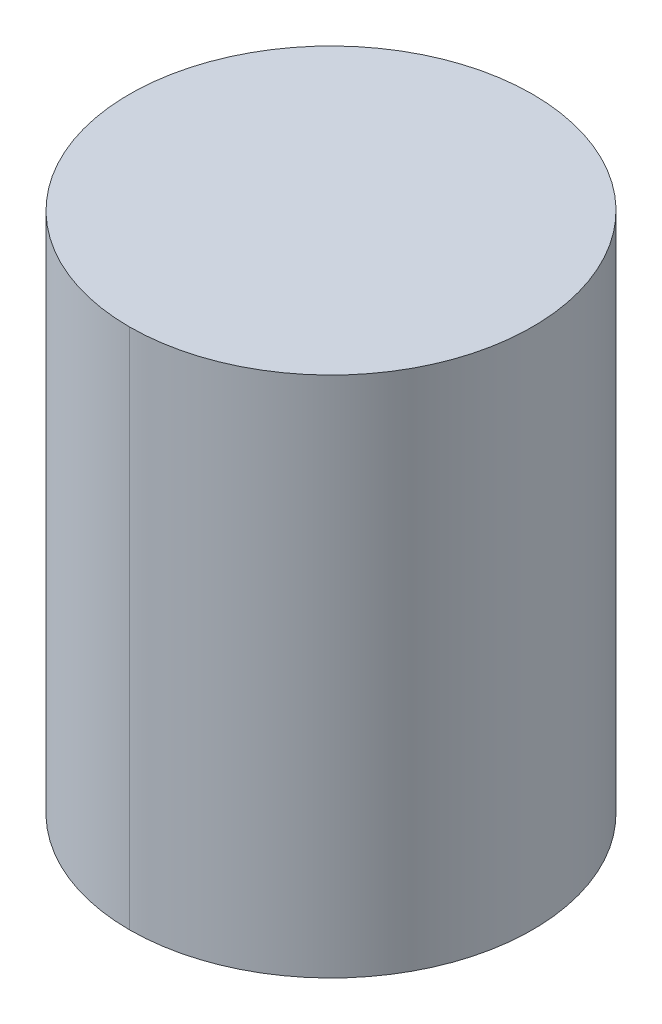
ISO-10303-21;
HEADER;
FILE_DESCRIPTION(('STEP AP214'),'2;1');
FILE_NAME('part.step','',(''),(''),'','','');
FILE_SCHEMA(('AUTOMOTIVE_DESIGN { 1 0 10303 214 1 1 1 1 }'));
ENDSEC;
DATA;
#1=APPLICATION_CONTEXT('core data for automotive mechanical design processes');
#2=APPLICATION_PROTOCOL_DEFINITION('international standard','automotive_design',2000,#1);
#3=PRODUCT_CONTEXT('',#1,'mechanical');
#4=PRODUCT('Part','Part','',(#3));
#5=PRODUCT_RELATED_PRODUCT_CATEGORY('part','',(#4));
#6=PRODUCT_DEFINITION_FORMATION('','',#4);
#7=PRODUCT_DEFINITION_CONTEXT('part definition',#1,'design');
#8=PRODUCT_DEFINITION('design','',#6,#7);
#9=PRODUCT_DEFINITION_SHAPE('','',#8);
#10=(LENGTH_UNIT() NAMED_UNIT(*) SI_UNIT(.MILLI.,.METRE.));
#11=(NAMED_UNIT(*) PLANE_ANGLE_UNIT() SI_UNIT($,.RADIAN.));
#12=(NAMED_UNIT(*) SI_UNIT($,.STERADIAN.) SOLID_ANGLE_UNIT());
#13=UNCERTAINTY_MEASURE_WITH_UNIT(LENGTH_MEASURE(1.E-05),#10,'distance_accuracy_value','');
#14=(GEOMETRIC_REPRESENTATION_CONTEXT(3) GLOBAL_UNCERTAINTY_ASSIGNED_CONTEXT((#13)) GLOBAL_UNIT_ASSIGNED_CONTEXT((#10,
#11,#12)) REPRESENTATION_CONTEXT('',''));
#15=CARTESIAN_POINT('',(0.,0.,0.));
#16=DIRECTION('',(0.,0.,1.));
#17=DIRECTION('',(1.,0.,0.));
#18=AXIS2_PLACEMENT_3D('',#15,#16,#17);
#19=CARTESIAN_POINT('',(12.5,61.1525,0.));
#20=DIRECTION('',(0.,1.,0.));
#21=DIRECTION('',(-1.,0.,0.));
#22=AXIS2_PLACEMENT_3D('',#19,#20,#21);
#23=CYLINDRICAL_SURFACE('',#22,5.5);
#24=CARTESIAN_POINT('',(12.5,61.1525,0.));
#25=DIRECTION('',(0.,-1.,0.));
#26=DIRECTION('',(0.,0.,-1.));
#27=AXIS2_PLACEMENT_3D('',#24,#25,#26);
#28=CIRCLE('',#27,5.5);
#29=CARTESIAN_POINT('',(12.5,61.1525,-5.5));
#30=VERTEX_POINT('',#29);
#31=CARTESIAN_POINT('',(12.5,61.1525,5.5));
#32=VERTEX_POINT('',#31);
#33=EDGE_CURVE('E11',#30,#32,#28,.T.);
#34=ORIENTED_EDGE('',*,*,#33,.F.);
#35=CARTESIAN_POINT('',(12.5,61.1525,-5.5));
#36=DIRECTION('',(0.,1.,0.));
#37=VECTOR('',#36,1.);
#38=LINE('',#35,#37);
#39=CARTESIAN_POINT('',(12.5,75.4025,-5.5));
#40=VERTEX_POINT('',#39);
#41=EDGE_CURVE('E26',#30,#40,#38,.T.);
#42=ORIENTED_EDGE('',*,*,#41,.T.);
#43=CARTESIAN_POINT('',(12.5,75.4025,0.));
#44=DIRECTION('',(0.,-1.,0.));
#45=DIRECTION('',(0.,0.,-1.));
#46=AXIS2_PLACEMENT_3D('',#43,#44,#45);
#47=CIRCLE('',#46,5.5);
#48=CARTESIAN_POINT('',(12.5,75.4025,5.5));
#49=VERTEX_POINT('',#48);
#50=EDGE_CURVE('E45',#40,#49,#47,.T.);
#51=ORIENTED_EDGE('',*,*,#50,.T.);
#52=CARTESIAN_POINT('',(12.5,61.1525,5.5));
#53=DIRECTION('',(0.,1.,0.));
#54=VECTOR('',#53,1.);
#55=LINE('',#52,#54);
#56=EDGE_CURVE('E41',#32,#49,#55,.T.);
#57=ORIENTED_EDGE('',*,*,#56,.F.);
#58=EDGE_LOOP('',(#34,#42,#51,#57));
#59=FACE_BOUND('',#58,.T.);
#60=ADVANCED_FACE('F17',(#59),#23,.T.);
#61=CARTESIAN_POINT('',(12.5,61.1525,0.));
#62=DIRECTION('',(0.,1.,0.));
#63=DIRECTION('',(1.,0.,0.));
#64=AXIS2_PLACEMENT_3D('',#61,#62,#63);
#65=CYLINDRICAL_SURFACE('',#64,5.5);
#66=CARTESIAN_POINT('',(12.5,75.4025,0.));
#67=DIRECTION('',(0.,-1.,0.));
#68=DIRECTION('',(0.,0.,-1.));
#69=AXIS2_PLACEMENT_3D('',#66,#67,#68);
#70=CIRCLE('',#69,5.5);
#71=EDGE_CURVE('E49',#49,#40,#70,.T.);
#72=ORIENTED_EDGE('',*,*,#71,.T.);
#73=ORIENTED_EDGE('',*,*,#41,.F.);
#74=CARTESIAN_POINT('',(12.5,61.1525,0.));
#75=DIRECTION('',(0.,-1.,0.));
#76=DIRECTION('',(0.,0.,-1.));
#77=AXIS2_PLACEMENT_3D('',#74,#75,#76);
#78=CIRCLE('',#77,5.5);
#79=EDGE_CURVE('E53',#32,#30,#78,.T.);
#80=ORIENTED_EDGE('',*,*,#79,.F.);
#81=ORIENTED_EDGE('',*,*,#56,.T.);
#82=EDGE_LOOP('',(#72,#73,#80,#81));
#83=FACE_BOUND('',#82,.T.);
#84=ADVANCED_FACE('F54',(#83),#65,.T.);
#85=CARTESIAN_POINT('',(18.,61.1525,0.));
#86=DIRECTION('',(0.,1.,0.));
#87=DIRECTION('',(0.,0.,1.));
#88=AXIS2_PLACEMENT_3D('',#85,#86,#87);
#89=PLANE('',#88);
#90=ORIENTED_EDGE('',*,*,#33,.T.);
#91=ORIENTED_EDGE('',*,*,#79,.T.);
#92=EDGE_LOOP('',(#90,#91));
#93=FACE_BOUND('',#92,.T.);
#94=ADVANCED_FACE('F58',(#93),#89,.F.);
#95=CARTESIAN_POINT('',(12.5,75.4025,0.));
#96=DIRECTION('',(0.,-1.,0.));
#97=DIRECTION('',(0.,0.,-1.));
#98=AXIS2_PLACEMENT_3D('',#95,#96,#97);
#99=PLANE('',#98);
#100=ORIENTED_EDGE('',*,*,#50,.F.);
#101=ORIENTED_EDGE('',*,*,#71,.F.);
#102=EDGE_LOOP('',(#100,#101));
#103=FACE_BOUND('',#102,.T.);
#104=ADVANCED_FACE('F60',(#103),#99,.F.);
#105=CLOSED_SHELL('',(#60,#84,#94,#104));
#106=MANIFOLD_SOLID_BREP('B1',#105);
#107=ADVANCED_BREP_SHAPE_REPRESENTATION('',(#18,#106),#14);
#108=SHAPE_DEFINITION_REPRESENTATION(#9,#107);
ENDSEC;
END-ISO-10303-21;
